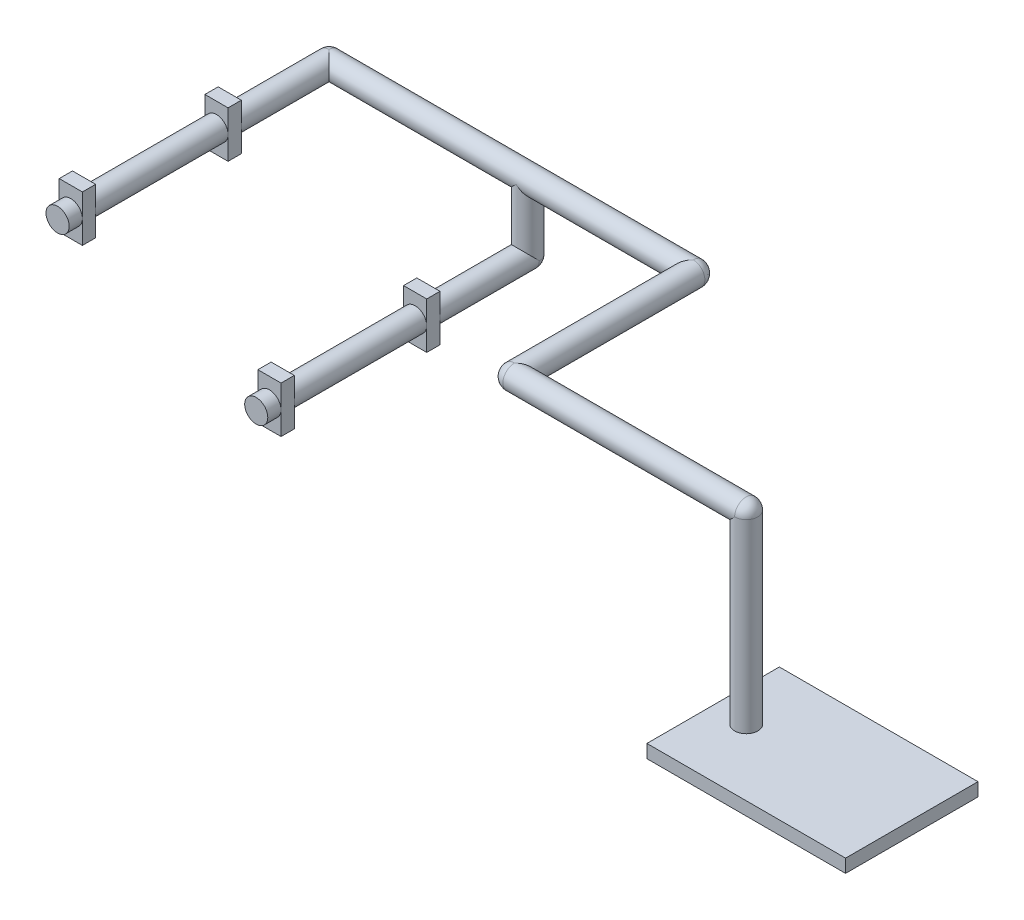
ISO-10303-21;
HEADER;
FILE_DESCRIPTION(('STEP AP214'),'2;1');
FILE_NAME('part.step','',(''),(''),'','','');
FILE_SCHEMA(('AUTOMOTIVE_DESIGN { 1 0 10303 214 1 1 1 1 }'));
ENDSEC;
DATA;
#1=APPLICATION_CONTEXT('core data for automotive mechanical design processes');
#2=APPLICATION_PROTOCOL_DEFINITION('international standard','automotive_design',2000,#1);
#3=PRODUCT_CONTEXT('',#1,'mechanical');
#4=PRODUCT('Part','Part','',(#3));
#5=PRODUCT_RELATED_PRODUCT_CATEGORY('part','',(#4));
#6=PRODUCT_DEFINITION_FORMATION('','',#4);
#7=PRODUCT_DEFINITION_CONTEXT('part definition',#1,'design');
#8=PRODUCT_DEFINITION('design','',#6,#7);
#9=PRODUCT_DEFINITION_SHAPE('','',#8);
#10=(LENGTH_UNIT() NAMED_UNIT(*) SI_UNIT(.MILLI.,.METRE.));
#11=(NAMED_UNIT(*) PLANE_ANGLE_UNIT() SI_UNIT($,.RADIAN.));
#12=(NAMED_UNIT(*) SI_UNIT($,.STERADIAN.) SOLID_ANGLE_UNIT());
#13=UNCERTAINTY_MEASURE_WITH_UNIT(LENGTH_MEASURE(1.E-05),#10,'distance_accuracy_value','');
#14=(GEOMETRIC_REPRESENTATION_CONTEXT(3) GLOBAL_UNCERTAINTY_ASSIGNED_CONTEXT((#13)) GLOBAL_UNIT_ASSIGNED_CONTEXT((#10,
#11,#12)) REPRESENTATION_CONTEXT('',''));
#15=CARTESIAN_POINT('',(0.,0.,0.));
#16=DIRECTION('',(0.,0.,1.));
#17=DIRECTION('',(1.,0.,0.));
#18=AXIS2_PLACEMENT_3D('',#15,#16,#17);
#19=CARTESIAN_POINT('',(50.,0.,54.));
#20=DIRECTION('',(0.,0.,-1.));
#21=DIRECTION('',(-1.,0.,0.));
#22=AXIS2_PLACEMENT_3D('',#19,#20,#21);
#23=CYLINDRICAL_SURFACE('',#22,3.5);
#24=CARTESIAN_POINT('',(50.,0.,0.));
#25=DIRECTION('',(0.,0.,1.));
#26=DIRECTION('',(1.,0.,0.));
#27=AXIS2_PLACEMENT_3D('',#24,#25,#26);
#28=CIRCLE('',#27,3.5);
#29=CARTESIAN_POINT('',(50.,-3.5,0.));
#30=VERTEX_POINT('',#29);
#31=CARTESIAN_POINT('',(50.,3.5,0.));
#32=VERTEX_POINT('',#31);
#33=EDGE_CURVE('E589',#30,#32,#28,.T.);
#34=ORIENTED_EDGE('',*,*,#33,.T.);
#35=CARTESIAN_POINT('',(50.,0.,0.));
#36=DIRECTION('',(-0.707106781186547,0.,-0.707106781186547));
#37=DIRECTION('',(-0.707106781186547,0.,0.707106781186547));
#38=AXIS2_PLACEMENT_3D('',#35,#36,#37);
#39=ELLIPSE('',#38,4.94974746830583,3.5);
#40=EDGE_CURVE('E584',#32,#30,#39,.F.);
#41=ORIENTED_EDGE('',*,*,#40,.T.);
#42=EDGE_LOOP('',(#34,#41));
#43=FACE_BOUND('',#42,.T.);
#44=CARTESIAN_POINT('',(50.,0.,54.));
#45=DIRECTION('',(-0.707106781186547,0.,-0.707106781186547));
#46=DIRECTION('',(0.707106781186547,0.,-0.707106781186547));
#47=AXIS2_PLACEMENT_3D('',#44,#45,#46);
#48=ELLIPSE('',#47,4.94974746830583,3.5);
#49=CARTESIAN_POINT('',(50.,-3.5,54.));
#50=VERTEX_POINT('',#49);
#51=CARTESIAN_POINT('',(50.,3.5,54.));
#52=VERTEX_POINT('',#51);
#53=EDGE_CURVE('E591',#50,#52,#48,.F.);
#54=ORIENTED_EDGE('',*,*,#53,.F.);
#55=CARTESIAN_POINT('',(50.,0.,54.));
#56=DIRECTION('',(0.,0.,1.));
#57=DIRECTION('',(1.,0.,0.));
#58=AXIS2_PLACEMENT_3D('',#55,#56,#57);
#59=CIRCLE('',#58,3.5);
#60=EDGE_CURVE('E587',#52,#50,#59,.T.);
#61=ORIENTED_EDGE('',*,*,#60,.F.);
#62=EDGE_LOOP('',(#54,#61));
#63=FACE_BOUND('',#62,.T.);
#64=ADVANCED_FACE('F32',(#43,#63),#23,.T.);
#65=CARTESIAN_POINT('',(50.,0.,0.));
#66=DIRECTION('',(-1.,0.,0.));
#67=DIRECTION('',(0.,0.,1.));
#68=AXIS2_PLACEMENT_3D('',#65,#66,#67);
#69=CYLINDRICAL_SURFACE('',#68,3.5);
#70=CARTESIAN_POINT('',(-60.,0.,0.));
#71=DIRECTION('',(-0.707106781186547,0.,0.707106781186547));
#72=DIRECTION('',(-0.707106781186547,0.,-0.707106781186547));
#73=AXIS2_PLACEMENT_3D('',#70,#71,#72);
#74=ELLIPSE('',#73,4.94974746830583,3.5);
#75=CARTESIAN_POINT('',(-60.,-3.5,0.));
#76=VERTEX_POINT('',#75);
#77=CARTESIAN_POINT('',(-60.,3.5,0.));
#78=VERTEX_POINT('',#77);
#79=EDGE_CURVE('E258',#76,#78,#74,.T.);
#80=ORIENTED_EDGE('',*,*,#79,.F.);
#81=CARTESIAN_POINT('',(-60.,0.,0.));
#82=DIRECTION('',(1.,0.,0.));
#83=DIRECTION('',(0.,0.,-1.));
#84=AXIS2_PLACEMENT_3D('',#81,#82,#83);
#85=CIRCLE('',#84,3.5);
#86=EDGE_CURVE('E249',#76,#78,#85,.T.);
#87=ORIENTED_EDGE('',*,*,#86,.T.);
#88=EDGE_LOOP('',(#80,#87));
#89=FACE_BOUND('',#88,.T.);
#90=CARTESIAN_POINT('',(0.,0.,0.));
#91=DIRECTION('',(-0.707106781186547,-0.707106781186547,0.));
#92=DIRECTION('',(-0.707106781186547,0.707106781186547,0.));
#93=AXIS2_PLACEMENT_3D('',#90,#91,#92);
#94=ELLIPSE('',#93,4.94974746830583,3.5);
#95=CARTESIAN_POINT('',(0.,0.,3.5));
#96=VERTEX_POINT('',#95);
#97=CARTESIAN_POINT('',(0.,0.,-3.5));
#98=VERTEX_POINT('',#97);
#99=EDGE_CURVE('E1152',#96,#98,#94,.F.);
#100=ORIENTED_EDGE('',*,*,#99,.T.);
#101=CARTESIAN_POINT('',(0.,0.,0.));
#102=DIRECTION('',(-0.707106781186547,0.707106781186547,0.));
#103=DIRECTION('',(-0.707106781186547,-0.707106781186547,0.));
#104=AXIS2_PLACEMENT_3D('',#101,#102,#103);
#105=ELLIPSE('',#104,4.94974746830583,3.5);
#106=EDGE_CURVE('E286',#98,#96,#105,.T.);
#107=ORIENTED_EDGE('',*,*,#106,.T.);
#108=EDGE_LOOP('',(#100,#107));
#109=FACE_BOUND('',#108,.T.);
#110=ORIENTED_EDGE('',*,*,#40,.F.);
#111=CARTESIAN_POINT('',(50.,0.,0.));
#112=DIRECTION('',(1.,0.,0.));
#113=DIRECTION('',(0.,0.,-1.));
#114=AXIS2_PLACEMENT_3D('',#111,#112,#113);
#115=CIRCLE('',#114,3.5);
#116=EDGE_CURVE('E259',#30,#32,#115,.T.);
#117=ORIENTED_EDGE('',*,*,#116,.F.);
#118=EDGE_LOOP('',(#110,#117));
#119=FACE_BOUND('',#118,.T.);
#120=ADVANCED_FACE('F34',(#89,#109,#119),#69,.T.);
#121=CARTESIAN_POINT('',(-3.5,-12.9891304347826,78.));
#122=DIRECTION('',(0.,0.,1.));
#123=DIRECTION('',(1.,0.,0.));
#124=AXIS2_PLACEMENT_3D('',#121,#122,#123);
#125=PLANE('',#124);
#126=DIRECTION('',(-1.,0.,0.));
#127=VECTOR('',#126,1.);
#128=CARTESIAN_POINT('',(3.5,-12.9891304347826,78.));
#129=LINE('',#128,#127);
#130=CARTESIAN_POINT('',(3.5,-12.9891304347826,78.));
#131=VERTEX_POINT('',#130);
#132=CARTESIAN_POINT('',(-3.5,-12.9891304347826,78.));
#133=VERTEX_POINT('',#132);
#134=EDGE_CURVE('E566',#131,#133,#129,.T.);
#135=ORIENTED_EDGE('',*,*,#134,.T.);
#136=DIRECTION('',(0.,-1.,0.));
#137=VECTOR('',#136,1.);
#138=CARTESIAN_POINT('',(-3.5,-12.9891304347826,78.));
#139=LINE('',#138,#137);
#140=CARTESIAN_POINT('',(-3.5,-26.9891304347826,78.));
#141=VERTEX_POINT('',#140);
#142=EDGE_CURVE('E564',#133,#141,#139,.T.);
#143=ORIENTED_EDGE('',*,*,#142,.T.);
#144=DIRECTION('',(1.,0.,0.));
#145=VECTOR('',#144,1.);
#146=CARTESIAN_POINT('',(-3.5,-26.9891304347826,78.));
#147=LINE('',#146,#145);
#148=CARTESIAN_POINT('',(3.5,-26.9891304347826,78.));
#149=VERTEX_POINT('',#148);
#150=EDGE_CURVE('E562',#141,#149,#147,.T.);
#151=ORIENTED_EDGE('',*,*,#150,.T.);
#152=DIRECTION('',(0.,1.,0.));
#153=VECTOR('',#152,1.);
#154=CARTESIAN_POINT('',(3.5,-26.9891304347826,78.));
#155=LINE('',#154,#153);
#156=EDGE_CURVE('E560',#149,#131,#155,.T.);
#157=ORIENTED_EDGE('',*,*,#156,.T.);
#158=EDGE_LOOP('',(#135,#143,#151,#157));
#159=FACE_BOUND('',#158,.T.);
#160=CARTESIAN_POINT('',(0.,-20.,78.));
#161=DIRECTION('',(0.,0.,1.));
#162=DIRECTION('',(1.,0.,0.));
#163=AXIS2_PLACEMENT_3D('',#160,#161,#162);
#164=CIRCLE('',#163,3.48914731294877);
#165=CARTESIAN_POINT('',(3.48914731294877,-20.,78.));
#166=VERTEX_POINT('',#165);
#167=EDGE_CURVE('E581',#166,#166,#164,.T.);
#168=ORIENTED_EDGE('',*,*,#167,.F.);
#169=EDGE_LOOP('',(#168));
#170=FACE_BOUND('',#169,.T.);
#171=ADVANCED_FACE('F495',(#159,#170),#125,.T.);
#172=CARTESIAN_POINT('',(-3.5,-26.9891304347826,34.));
#173=DIRECTION('',(0.,0.,1.));
#174=DIRECTION('',(1.,0.,0.));
#175=AXIS2_PLACEMENT_3D('',#172,#173,#174);
#176=PLANE('',#175);
#177=DIRECTION('',(0.,-1.,0.));
#178=VECTOR('',#177,1.);
#179=CARTESIAN_POINT('',(-3.5,-12.9891304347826,34.));
#180=LINE('',#179,#178);
#181=CARTESIAN_POINT('',(-3.5,-12.9891304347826,34.));
#182=VERTEX_POINT('',#181);
#183=CARTESIAN_POINT('',(-3.5,-26.9891304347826,34.));
#184=VERTEX_POINT('',#183);
#185=EDGE_CURVE('E378',#182,#184,#180,.T.);
#186=ORIENTED_EDGE('',*,*,#185,.T.);
#187=DIRECTION('',(1.,0.,0.));
#188=VECTOR('',#187,1.);
#189=CARTESIAN_POINT('',(-3.5,-26.9891304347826,34.));
#190=LINE('',#189,#188);
#191=CARTESIAN_POINT('',(3.5,-26.9891304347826,34.));
#192=VERTEX_POINT('',#191);
#193=EDGE_CURVE('E381',#184,#192,#190,.T.);
#194=ORIENTED_EDGE('',*,*,#193,.T.);
#195=DIRECTION('',(0.,1.,0.));
#196=VECTOR('',#195,1.);
#197=CARTESIAN_POINT('',(3.5,-12.9891304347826,34.));
#198=LINE('',#197,#196);
#199=CARTESIAN_POINT('',(3.5,-12.9891304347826,34.));
#200=VERTEX_POINT('',#199);
#201=EDGE_CURVE('E384',#192,#200,#198,.T.);
#202=ORIENTED_EDGE('',*,*,#201,.T.);
#203=DIRECTION('',(-1.,0.,0.));
#204=VECTOR('',#203,1.);
#205=CARTESIAN_POINT('',(-3.5,-12.9891304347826,34.));
#206=LINE('',#205,#204);
#207=EDGE_CURVE('E388',#200,#182,#206,.T.);
#208=ORIENTED_EDGE('',*,*,#207,.T.);
#209=EDGE_LOOP('',(#186,#194,#202,#208));
#210=FACE_BOUND('',#209,.T.);
#211=CARTESIAN_POINT('',(0.,-20.,34.));
#212=DIRECTION('',(0.,0.,1.));
#213=DIRECTION('',(1.,0.,0.));
#214=AXIS2_PLACEMENT_3D('',#211,#212,#213);
#215=CIRCLE('',#214,3.48914731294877);
#216=CARTESIAN_POINT('',(3.48914731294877,-20.,34.));
#217=VERTEX_POINT('',#216);
#218=EDGE_CURVE('E544',#217,#217,#215,.T.);
#219=ORIENTED_EDGE('',*,*,#218,.F.);
#220=EDGE_LOOP('',(#219));
#221=FACE_BOUND('',#220,.T.);
#222=ADVANCED_FACE('F439',(#210,#221),#176,.T.);
#223=CARTESIAN_POINT('',(-63.5,7.,78.));
#224=DIRECTION('',(0.,0.,-1.));
#225=DIRECTION('',(-1.,0.,0.));
#226=AXIS2_PLACEMENT_3D('',#223,#224,#225);
#227=PLANE('',#226);
#228=CARTESIAN_POINT('',(-60.,0.,78.));
#229=DIRECTION('',(0.,0.,1.));
#230=DIRECTION('',(1.,0.,0.));
#231=AXIS2_PLACEMENT_3D('',#228,#229,#230);
#232=CIRCLE('',#231,3.5);
#233=CARTESIAN_POINT('',(-56.5,0.,78.));
#234=VERTEX_POINT('',#233);
#235=CARTESIAN_POINT('',(-63.5,0.,78.));
#236=VERTEX_POINT('',#235);
#237=EDGE_CURVE('E398',#234,#236,#232,.T.);
#238=ORIENTED_EDGE('',*,*,#237,.F.);
#239=DIRECTION('',(0.,1.,0.));
#240=VECTOR('',#239,1.);
#241=CARTESIAN_POINT('',(-56.5,-7.,78.));
#242=LINE('',#241,#240);
#243=CARTESIAN_POINT('',(-56.5,7.,78.));
#244=VERTEX_POINT('',#243);
#245=EDGE_CURVE('E1083',#234,#244,#242,.T.);
#246=ORIENTED_EDGE('',*,*,#245,.T.);
#247=DIRECTION('',(-1.,0.,0.));
#248=VECTOR('',#247,1.);
#249=CARTESIAN_POINT('',(-56.5,7.,78.));
#250=LINE('',#249,#248);
#251=CARTESIAN_POINT('',(-63.5,7.,78.));
#252=VERTEX_POINT('',#251);
#253=EDGE_CURVE('E1063',#244,#252,#250,.T.);
#254=ORIENTED_EDGE('',*,*,#253,.T.);
#255=DIRECTION('',(0.,-1.,0.));
#256=VECTOR('',#255,1.);
#257=CARTESIAN_POINT('',(-63.5,7.,78.));
#258=LINE('',#257,#256);
#259=EDGE_CURVE('E1055',#252,#236,#258,.T.);
#260=ORIENTED_EDGE('',*,*,#259,.T.);
#261=EDGE_LOOP('',(#238,#246,#254,#260));
#262=FACE_BOUND('',#261,.T.);
#263=ADVANCED_FACE('F435',(#262),#227,.F.);
#264=EDGE_CURVE('E1041',#236,#234,#232,.T.);
#265=ORIENTED_EDGE('',*,*,#264,.F.);
#266=CARTESIAN_POINT('',(-63.5,-7.,78.));
#267=VERTEX_POINT('',#266);
#268=EDGE_CURVE('E1043',#236,#267,#258,.T.);
#269=ORIENTED_EDGE('',*,*,#268,.T.);
#270=DIRECTION('',(1.,0.,0.));
#271=VECTOR('',#270,1.);
#272=CARTESIAN_POINT('',(-63.5,-7.,78.));
#273=LINE('',#272,#271);
#274=CARTESIAN_POINT('',(-56.5,-7.,78.));
#275=VERTEX_POINT('',#274);
#276=EDGE_CURVE('E1065',#267,#275,#273,.T.);
#277=ORIENTED_EDGE('',*,*,#276,.T.);
#278=EDGE_CURVE('E1046',#275,#234,#242,.T.);
#279=ORIENTED_EDGE('',*,*,#278,.T.);
#280=EDGE_LOOP('',(#265,#269,#277,#279));
#281=FACE_BOUND('',#280,.T.);
#282=ADVANCED_FACE('F438',(#281),#227,.F.);
#283=CARTESIAN_POINT('',(-63.5,7.,34.));
#284=DIRECTION('',(0.,0.,1.));
#285=DIRECTION('',(1.,0.,0.));
#286=AXIS2_PLACEMENT_3D('',#283,#284,#285);
#287=PLANE('',#286);
#288=CARTESIAN_POINT('',(-60.,0.,34.));
#289=DIRECTION('',(0.,0.,1.));
#290=DIRECTION('',(1.,0.,0.));
#291=AXIS2_PLACEMENT_3D('',#288,#289,#290);
#292=CIRCLE('',#291,3.5);
#293=CARTESIAN_POINT('',(-56.5,0.,34.));
#294=VERTEX_POINT('',#293);
#295=CARTESIAN_POINT('',(-63.5,0.,34.));
#296=VERTEX_POINT('',#295);
#297=EDGE_CURVE('E1095',#294,#296,#292,.T.);
#298=ORIENTED_EDGE('',*,*,#297,.F.);
#299=DIRECTION('',(0.,1.,0.));
#300=VECTOR('',#299,1.);
#301=CARTESIAN_POINT('',(-56.5,7.,34.));
#302=LINE('',#301,#300);
#303=CARTESIAN_POINT('',(-56.5,7.,34.));
#304=VERTEX_POINT('',#303);
#305=EDGE_CURVE('E1119',#294,#304,#302,.T.);
#306=ORIENTED_EDGE('',*,*,#305,.T.);
#307=DIRECTION('',(-1.,0.,0.));
#308=VECTOR('',#307,1.);
#309=CARTESIAN_POINT('',(-63.5,7.,34.));
#310=LINE('',#309,#308);
#311=CARTESIAN_POINT('',(-63.5,7.,34.));
#312=VERTEX_POINT('',#311);
#313=EDGE_CURVE('E1122',#304,#312,#310,.T.);
#314=ORIENTED_EDGE('',*,*,#313,.T.);
#315=DIRECTION('',(0.,-1.,0.));
#316=VECTOR('',#315,1.);
#317=CARTESIAN_POINT('',(-63.5,7.,34.));
#318=LINE('',#317,#316);
#319=EDGE_CURVE('E1114',#312,#296,#318,.T.);
#320=ORIENTED_EDGE('',*,*,#319,.T.);
#321=EDGE_LOOP('',(#298,#306,#314,#320));
#322=FACE_BOUND('',#321,.T.);
#323=ADVANCED_FACE('F470',(#322),#287,.T.);
#324=CARTESIAN_POINT('',(0.,-20.,0.));
#325=DIRECTION('',(0.,1.,0.));
#326=DIRECTION('',(0.,0.,1.));
#327=AXIS2_PLACEMENT_3D('',#324,#325,#326);
#328=CYLINDRICAL_SURFACE('',#327,3.5);
#329=ORIENTED_EDGE('',*,*,#106,.F.);
#330=ORIENTED_EDGE('',*,*,#99,.F.);
#331=EDGE_LOOP('',(#329,#330));
#332=FACE_BOUND('',#331,.T.);
#333=CARTESIAN_POINT('',(-3.5,-19.9782608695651,0.));
#334=CARTESIAN_POINT('',(-3.50000000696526,-19.9782652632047,0.000751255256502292));
#335=CARTESIAN_POINT('',(-3.49999975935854,-19.9781832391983,0.00149521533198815));
#336=CARTESIAN_POINT('',(-3.49999883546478,-19.9778905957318,0.00294028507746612));
#337=CARTESIAN_POINT('',(-3.49999816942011,-19.977683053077,0.00364199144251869));
#338=CARTESIAN_POINT('',(-3.49999544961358,-19.9768718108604,0.00584912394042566));
#339=CARTESIAN_POINT('',(-3.49999269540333,-19.9760942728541,0.00728602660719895));
#340=CARTESIAN_POINT('',(-3.49998579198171,-19.9743497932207,0.0100684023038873));
#341=CARTESIAN_POINT('',(-3.49998161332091,-19.9733790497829,0.0114111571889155));
#342=CARTESIAN_POINT('',(-3.49993452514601,-19.9636146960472,0.0244468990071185));
#343=CARTESIAN_POINT('',(-3.49984475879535,-19.9531430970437,0.0347727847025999));
#344=CARTESIAN_POINT('',(-3.49916899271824,-19.9011980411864,0.0863377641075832));
#345=CARTESIAN_POINT('',(-3.49790152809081,-19.8604511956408,0.127883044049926));
#346=CARTESIAN_POINT('',(-3.49190297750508,-19.7374851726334,0.252193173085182));
#347=CARTESIAN_POINT('',(-3.4849729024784,-19.6546634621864,0.334503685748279));
#348=CARTESIAN_POINT('',(-3.46522649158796,-19.4898102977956,0.499000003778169));
#349=CARTESIAN_POINT('',(-3.45241094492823,-19.4077787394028,0.581185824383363));
#350=CARTESIAN_POINT('',(-3.41229546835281,-19.1999905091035,0.789169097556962));
#351=CARTESIAN_POINT('',(-3.38091091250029,-19.0745477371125,0.914546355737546));
#352=CARTESIAN_POINT('',(-3.30363067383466,-18.8258833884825,1.16316964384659));
#353=CARTESIAN_POINT('',(-3.25772517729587,-18.7026633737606,1.28641417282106));
#354=CARTESIAN_POINT('',(-3.15083135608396,-18.4594164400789,1.52968297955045));
#355=CARTESIAN_POINT('',(-3.08983470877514,-18.3393913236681,1.64970543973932));
#356=CARTESIAN_POINT('',(-2.9521282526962,-18.1040207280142,1.8850765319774));
#357=CARTESIAN_POINT('',(-2.87542972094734,-17.9886719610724,2.00042844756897));
#358=CARTESIAN_POINT('',(-2.68566217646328,-17.7380233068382,2.25108171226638));
#359=CARTESIAN_POINT('',(-2.56828296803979,-17.604324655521,2.38478126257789));
#360=CARTESIAN_POINT('',(-2.30692347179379,-17.3507066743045,2.63840123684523));
#361=CARTESIAN_POINT('',(-2.162990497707,-17.2307634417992,2.75834556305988));
#362=CARTESIAN_POINT('',(-1.87864363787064,-17.0319841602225,2.95712635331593));
#363=CARTESIAN_POINT('',(-1.74308129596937,-16.9497001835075,3.03941083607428));
#364=CARTESIAN_POINT('',(-1.45483773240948,-16.8017005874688,3.18741131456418));
#365=CARTESIAN_POINT('',(-1.30217661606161,-16.7359657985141,3.25314648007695));
#366=CARTESIAN_POINT('',(-1.00979007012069,-16.6350167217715,3.35409610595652));
#367=CARTESIAN_POINT('',(-0.872357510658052,-16.5964973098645,3.39261571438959));
#368=CARTESIAN_POINT('',(-0.590293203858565,-16.536244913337,3.45286841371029));
#369=CARTESIAN_POINT('',(-0.44566623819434,-16.5145009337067,3.47461249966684));
#370=CARTESIAN_POINT('',(-0.152705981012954,-16.489347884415,3.49976567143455));
#371=CARTESIAN_POINT('',(-0.00436165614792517,-16.4860021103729,3.50311146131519));
#372=CARTESIAN_POINT('',(0.290781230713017,-16.4980871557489,3.49102635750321));
#373=CARTESIAN_POINT('',(0.437579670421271,-16.5135194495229,3.47559398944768));
#374=CARTESIAN_POINT('',(0.717690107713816,-16.5606934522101,3.42841975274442));
#375=CARTESIAN_POINT('',(0.85130671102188,-16.5915479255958,3.39756512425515));
#376=CARTESIAN_POINT('',(1.11036049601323,-16.6671642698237,3.3219483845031));
#377=CARTESIAN_POINT('',(1.23579429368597,-16.7119318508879,3.27718056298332));
#378=CARTESIAN_POINT('',(1.52215724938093,-16.8323110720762,3.15680065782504));
#379=CARTESIAN_POINT('',(1.67866178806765,-16.9131892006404,3.07592204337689));
#380=CARTESIAN_POINT('',(1.97105433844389,-17.0917940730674,2.89731599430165));
#381=CARTESIAN_POINT('',(2.1069032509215,-17.1895520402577,2.79955733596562));
#382=CARTESIAN_POINT('',(2.40458606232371,-17.4360829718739,2.55302437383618));
#383=CARTESIAN_POINT('',(2.55733551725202,-17.5903193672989,2.39878649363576));
#384=CARTESIAN_POINT('',(2.82640826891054,-17.9140420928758,2.07506009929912));
#385=CARTESIAN_POINT('',(2.94264737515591,-18.0835625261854,1.90553748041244));
#386=CARTESIAN_POINT('',(3.10860997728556,-18.3751710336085,1.61392279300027));
#387=CARTESIAN_POINT('',(3.167660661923,-18.4946825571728,1.49440809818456));
#388=CARTESIAN_POINT('',(3.27099794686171,-18.7369170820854,1.25216710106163));
#389=CARTESIAN_POINT('',(3.31527811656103,-18.8596414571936,1.12943942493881));
#390=CARTESIAN_POINT('',(3.38945906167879,-19.1069106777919,0.882151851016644));
#391=CARTESIAN_POINT('',(3.41939336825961,-19.2314505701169,0.757596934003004));
#392=CARTESIAN_POINT('',(3.46538137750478,-19.481761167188,0.507265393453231));
#393=CARTESIAN_POINT('',(3.48144224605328,-19.6075312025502,0.381489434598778));
#394=CARTESIAN_POINT('',(3.49348624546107,-19.7719596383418,0.216902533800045));
#395=CARTESIAN_POINT('',(3.49566746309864,-19.8104835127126,0.178330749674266));
#396=CARTESIAN_POINT('',(3.4980489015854,-19.8699259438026,0.118724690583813));
#397=CARTESIAN_POINT('',(3.49869889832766,-19.8908527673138,0.0977230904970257));
#398=CARTESIAN_POINT('',(3.49940758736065,-19.9228743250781,0.0653756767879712));
#399=CARTESIAN_POINT('',(3.49960069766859,-19.9340213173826,0.0540756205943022));
#400=CARTESIAN_POINT('',(3.49981027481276,-19.950699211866,0.0369021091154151));
#401=CARTESIAN_POINT('',(3.49986688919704,-19.9562886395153,0.0311008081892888));
#402=CARTESIAN_POINT('',(3.49993049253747,-19.9643874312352,0.0222470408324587));
#403=CARTESIAN_POINT('',(3.49994808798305,-19.9670213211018,0.0192925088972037));
#404=CARTESIAN_POINT('',(3.49997632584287,-19.9721139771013,0.0132373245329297));
#405=CARTESIAN_POINT('',(3.49998705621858,-19.9745745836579,0.0101390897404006));
#406=CARTESIAN_POINT('',(3.49999434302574,-19.9765687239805,0.00630216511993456));
#407=CARTESIAN_POINT('',(3.49999498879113,-19.9767506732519,0.00593410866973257));
#408=CARTESIAN_POINT('',(3.49999617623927,-19.9770913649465,0.00518746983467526));
#409=CARTESIAN_POINT('',(3.49999671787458,-19.9772500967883,0.00480888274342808));
#410=CARTESIAN_POINT('',(3.49999816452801,-19.9776813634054,0.00366361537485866));
#411=CARTESIAN_POINT('',(3.49999890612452,-19.9779131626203,0.00287986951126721));
#412=CARTESIAN_POINT('',(3.49999958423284,-19.9781276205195,0.00173994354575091));
#413=CARTESIAN_POINT('',(3.49999973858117,-19.9781769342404,0.00139598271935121));
#414=CARTESIAN_POINT('',(3.49999994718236,-19.9782438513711,0.000701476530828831));
#415=CARTESIAN_POINT('',(3.50000000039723,-19.9782611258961,0.000350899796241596));
#416=CARTESIAN_POINT('',(3.50000000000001,-19.9782608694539,-2.0897374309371E-11));
#417=B_SPLINE_CURVE_WITH_KNOTS('',3,(#333,#334,#335,#336,#337,#338,#339,#340,#341,#342,#343,
#344,#345,#346,#347,#348,#349,#350,#351,#352,#353,#354,#355,#356,#357,#358,#359,#360,#361,#362,
#363,#364,#365,#366,#367,#368,#369,#370,#371,#372,#373,#374,#375,#376,#377,#378,#379,#380,#381,
#382,#383,#384,#385,#386,#387,#388,#389,#390,#391,#392,#393,#394,#395,#396,#397,#398,#399,#400,
#401,#402,#403,#404,#405,#406,#407,#408,#409,#410,#411,#412,#413,#414,#415,#416),.UNSPECIFIED.,
.F.,.F.,(4,2,2,2,2,2,2,2,2,2,2,2,2,2,2,2,2,2,2,2,2,2,2,2,2,2,2,2,2,2,2,2,2,2,2,2,2,2,2,2,2,4),
(0.,0.00223777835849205,0.00442280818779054,0.00928469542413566,0.0142538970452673,
0.0581722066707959,0.233134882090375,0.583596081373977,0.934010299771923,1.47368769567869,
2.01373060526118,2.55407201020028,3.09402669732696,3.75959374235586,4.42398613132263,
4.95800755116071,5.49140751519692,5.93304271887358,6.37438821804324,6.81725113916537,
7.26014883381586,7.68007971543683,8.10018317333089,8.67851328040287,9.25792483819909,
10.0525031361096,10.8489004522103,11.3853753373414,11.9220834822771,12.4575309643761,
12.9927017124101,13.156374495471,13.2453261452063,13.2929637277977,13.3171076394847,
13.3290076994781,13.34075205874,13.3419827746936,13.3432140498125,13.345650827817,
13.3466919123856,13.3477436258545),.UNSPECIFIED.);
#418=CARTESIAN_POINT('',(-3.5,-19.9782608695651,0.));
#419=VERTEX_POINT('',#418);
#420=CARTESIAN_POINT('',(3.5,-19.9782608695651,0.));
#421=VERTEX_POINT('',#420);
#422=EDGE_CURVE('E273',#419,#421,#417,.T.);
#423=ORIENTED_EDGE('',*,*,#422,.T.);
#424=CARTESIAN_POINT('',(0.,-19.9891304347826,0.));
#425=DIRECTION('',(0.,0.,1.));
#426=DIRECTION('',(0.999995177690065,-0.00310557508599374,0.));
#427=AXIS2_PLACEMENT_3D('',#424,#425,#426);
#428=CIRCLE('',#427,3.50001687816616);
#429=CARTESIAN_POINT('',(3.5,-20.,0.));
#430=VERTEX_POINT('',#429);
#431=EDGE_CURVE('E276',#430,#421,#428,.T.);
#432=ORIENTED_EDGE('',*,*,#431,.F.);
#433=CARTESIAN_POINT('',(0.,-20.,0.));
#434=DIRECTION('',(0.,1.,0.));
#435=DIRECTION('',(0.,0.,1.));
#436=AXIS2_PLACEMENT_3D('',#433,#434,#435);
#437=CIRCLE('',#436,3.5);
#438=CARTESIAN_POINT('',(-3.5,-20.,0.));
#439=VERTEX_POINT('',#438);
#440=EDGE_CURVE('E260',#430,#439,#437,.T.);
#441=ORIENTED_EDGE('',*,*,#440,.T.);
#442=CARTESIAN_POINT('',(0.,-19.9891304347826,0.));
#443=DIRECTION('',(0.,0.,1.));
#444=DIRECTION('',(-0.999995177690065,0.00310557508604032,0.));
#445=AXIS2_PLACEMENT_3D('',#442,#443,#444);
#446=CIRCLE('',#445,3.50001687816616);
#447=EDGE_CURVE('E339',#419,#439,#446,.T.);
#448=ORIENTED_EDGE('',*,*,#447,.F.);
#449=EDGE_LOOP('',(#423,#432,#441,#448));
#450=FACE_BOUND('',#449,.T.);
#451=ADVANCED_FACE('F289',(#332,#450),#328,.T.);
#452=CARTESIAN_POINT('',(0.,-20.,0.));
#453=DIRECTION('',(0.,1.,0.));
#454=DIRECTION('',(0.,0.,1.));
#455=AXIS2_PLACEMENT_3D('',#452,#453,#454);
#456=PLANE('',#455);
#457=ORIENTED_EDGE('',*,*,#440,.F.);
#458=CARTESIAN_POINT('',(0.,-20.,0.0108695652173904));
#459=DIRECTION('',(0.,1.,0.));
#460=DIRECTION('',(0.,0.,1.));
#461=AXIS2_PLACEMENT_3D('',#458,#459,#460);
#462=CIRCLE('',#461,3.50001687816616);
#463=EDGE_CURVE('E36',#430,#439,#462,.T.);
#464=ORIENTED_EDGE('',*,*,#463,.T.);
#465=EDGE_LOOP('',(#457,#464));
#466=FACE_BOUND('',#465,.T.);
#467=ADVANCED_FACE('F296',(#466),#456,.F.);
#468=CARTESIAN_POINT('',(0.,-19.9891304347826,30.));
#469=DIRECTION('',(0.,0.,-1.));
#470=DIRECTION('',(-1.,0.,0.));
#471=AXIS2_PLACEMENT_3D('',#468,#469,#470);
#472=CYLINDRICAL_SURFACE('',#471,3.50001687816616);
#473=ORIENTED_EDGE('',*,*,#422,.F.);
#474=ORIENTED_EDGE('',*,*,#447,.T.);
#475=CARTESIAN_POINT('',(0.,-19.9891304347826,0.));
#476=DIRECTION('',(0.,0.,1.));
#477=DIRECTION('',(1.,0.,0.));
#478=AXIS2_PLACEMENT_3D('',#475,#476,#477);
#479=CIRCLE('',#478,3.50001687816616);
#480=EDGE_CURVE('E263',#439,#430,#479,.T.);
#481=ORIENTED_EDGE('',*,*,#480,.T.);
#482=ORIENTED_EDGE('',*,*,#431,.T.);
#483=EDGE_LOOP('',(#473,#474,#481,#482));
#484=FACE_BOUND('',#483,.T.);
#485=CARTESIAN_POINT('',(0.,-19.9891304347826,30.));
#486=DIRECTION('',(0.,0.,1.));
#487=DIRECTION('',(1.,0.,0.));
#488=AXIS2_PLACEMENT_3D('',#485,#486,#487);
#489=CIRCLE('',#488,3.50001687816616);
#490=CARTESIAN_POINT('',(3.5,-19.978260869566,30.));
#491=VERTEX_POINT('',#490);
#492=CARTESIAN_POINT('',(-3.5,-19.9782608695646,30.));
#493=VERTEX_POINT('',#492);
#494=EDGE_CURVE('E328',#491,#493,#489,.T.);
#495=ORIENTED_EDGE('',*,*,#494,.F.);
#496=CARTESIAN_POINT('',(3.5,-19.9999999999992,30.));
#497=DIRECTION('',(0.,1.,0.));
#498=VECTOR('',#497,1.);
#499=LINE('',#496,#498);
#500=CARTESIAN_POINT('',(3.5,-19.9999999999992,30.));
#501=VERTEX_POINT('',#500);
#502=EDGE_CURVE('E42',#501,#491,#499,.T.);
#503=ORIENTED_EDGE('',*,*,#502,.F.);
#504=CARTESIAN_POINT('',(-3.5,-20.0000000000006,30.));
#505=VERTEX_POINT('',#504);
#506=EDGE_CURVE('E53',#505,#501,#489,.T.);
#507=ORIENTED_EDGE('',*,*,#506,.F.);
#508=CARTESIAN_POINT('',(-3.5,-19.9782608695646,30.));
#509=DIRECTION('',(0.,-1.,0.));
#510=VECTOR('',#509,1.);
#511=LINE('',#508,#510);
#512=EDGE_CURVE('E11',#493,#505,#511,.T.);
#513=ORIENTED_EDGE('',*,*,#512,.F.);
#514=EDGE_LOOP('',(#495,#503,#507,#513));
#515=FACE_BOUND('',#514,.T.);
#516=ADVANCED_FACE('F292',(#484,#515),#472,.T.);
#517=CARTESIAN_POINT('',(-60.,0.,30.));
#518=DIRECTION('',(0.,0.,-1.));
#519=DIRECTION('',(-1.,0.,0.));
#520=AXIS2_PLACEMENT_3D('',#517,#518,#519);
#521=CYLINDRICAL_SURFACE('',#520,3.5);
#522=CARTESIAN_POINT('',(-60.,0.,30.));
#523=DIRECTION('',(0.,0.,1.));
#524=DIRECTION('',(1.,0.,0.));
#525=AXIS2_PLACEMENT_3D('',#522,#523,#524);
#526=CIRCLE('',#525,3.5);
#527=CARTESIAN_POINT('',(-56.5,0.,30.));
#528=VERTEX_POINT('',#527);
#529=CARTESIAN_POINT('',(-63.5,0.,30.));
#530=VERTEX_POINT('',#529);
#531=EDGE_CURVE('E264',#528,#530,#526,.T.);
#532=ORIENTED_EDGE('',*,*,#531,.F.);
#533=EDGE_CURVE('E253',#530,#528,#526,.T.);
#534=ORIENTED_EDGE('',*,*,#533,.F.);
#535=EDGE_LOOP('',(#532,#534));
#536=FACE_BOUND('',#535,.T.);
#537=CARTESIAN_POINT('',(-60.,0.,0.));
#538=DIRECTION('',(0.,0.,1.));
#539=DIRECTION('',(1.,0.,0.));
#540=AXIS2_PLACEMENT_3D('',#537,#538,#539);
#541=CIRCLE('',#540,3.5);
#542=EDGE_CURVE('E246',#78,#76,#541,.T.);
#543=ORIENTED_EDGE('',*,*,#542,.T.);
#544=ORIENTED_EDGE('',*,*,#79,.T.);
#545=EDGE_LOOP('',(#543,#544));
#546=FACE_BOUND('',#545,.T.);
#547=ADVANCED_FACE('F262',(#536,#546),#521,.T.);
#548=CARTESIAN_POINT('',(-63.5,7.,30.));
#549=DIRECTION('',(0.,0.,1.));
#550=DIRECTION('',(1.,0.,0.));
#551=AXIS2_PLACEMENT_3D('',#548,#549,#550);
#552=PLANE('',#551);
#553=DIRECTION('',(0.,1.,0.));
#554=VECTOR('',#553,1.);
#555=CARTESIAN_POINT('',(-56.5,7.,30.));
#556=LINE('',#555,#554);
#557=CARTESIAN_POINT('',(-56.5,7.,30.));
#558=VERTEX_POINT('',#557);
#559=EDGE_CURVE('E1107',#528,#558,#556,.T.);
#560=ORIENTED_EDGE('',*,*,#559,.F.);
#561=ORIENTED_EDGE('',*,*,#531,.T.);
#562=DIRECTION('',(0.,-1.,0.));
#563=VECTOR('',#562,1.);
#564=CARTESIAN_POINT('',(-63.5,7.,30.));
#565=LINE('',#564,#563);
#566=CARTESIAN_POINT('',(-63.5,7.,30.));
#567=VERTEX_POINT('',#566);
#568=EDGE_CURVE('E1103',#567,#530,#565,.T.);
#569=ORIENTED_EDGE('',*,*,#568,.F.);
#570=DIRECTION('',(-1.,0.,0.));
#571=VECTOR('',#570,1.);
#572=CARTESIAN_POINT('',(-63.5,7.,30.));
#573=LINE('',#572,#571);
#574=EDGE_CURVE('E1111',#558,#567,#573,.T.);
#575=ORIENTED_EDGE('',*,*,#574,.F.);
#576=EDGE_LOOP('',(#560,#561,#569,#575));
#577=FACE_BOUND('',#576,.T.);
#578=ADVANCED_FACE('F461',(#577),#552,.F.);
#579=CARTESIAN_POINT('',(-63.5,-7.,30.));
#580=VERTEX_POINT('',#579);
#581=EDGE_CURVE('E1102',#530,#580,#565,.T.);
#582=ORIENTED_EDGE('',*,*,#581,.F.);
#583=ORIENTED_EDGE('',*,*,#533,.T.);
#584=CARTESIAN_POINT('',(-56.5,-7.,30.));
#585=VERTEX_POINT('',#584);
#586=EDGE_CURVE('E1108',#585,#528,#556,.T.);
#587=ORIENTED_EDGE('',*,*,#586,.F.);
#588=DIRECTION('',(1.,0.,0.));
#589=VECTOR('',#588,1.);
#590=CARTESIAN_POINT('',(-63.5,-7.,30.));
#591=LINE('',#590,#589);
#592=EDGE_CURVE('E1105',#580,#585,#591,.T.);
#593=ORIENTED_EDGE('',*,*,#592,.F.);
#594=EDGE_LOOP('',(#582,#583,#587,#593));
#595=FACE_BOUND('',#594,.T.);
#596=ADVANCED_FACE('F464',(#595),#552,.F.);
#597=CARTESIAN_POINT('',(-63.5,7.,34.));
#598=DIRECTION('',(1.,0.,0.));
#599=DIRECTION('',(0.,0.,-1.));
#600=AXIS2_PLACEMENT_3D('',#597,#598,#599);
#601=PLANE('',#600);
#602=ORIENTED_EDGE('',*,*,#568,.T.);
#603=ORIENTED_EDGE('',*,*,#581,.T.);
#604=DIRECTION('',(0.,0.,-1.));
#605=VECTOR('',#604,1.);
#606=CARTESIAN_POINT('',(-63.5,-7.,34.));
#607=LINE('',#606,#605);
#608=CARTESIAN_POINT('',(-63.5,-7.,34.));
#609=VERTEX_POINT('',#608);
#610=EDGE_CURVE('E254',#609,#580,#607,.T.);
#611=ORIENTED_EDGE('',*,*,#610,.F.);
#612=EDGE_CURVE('E1113',#296,#609,#318,.T.);
#613=ORIENTED_EDGE('',*,*,#612,.F.);
#614=ORIENTED_EDGE('',*,*,#319,.F.);
#615=DIRECTION('',(0.,0.,-1.));
#616=VECTOR('',#615,1.);
#617=CARTESIAN_POINT('',(-63.5,7.,34.));
#618=LINE('',#617,#616);
#619=EDGE_CURVE('E1124',#312,#567,#618,.T.);
#620=ORIENTED_EDGE('',*,*,#619,.T.);
#621=EDGE_LOOP('',(#602,#603,#611,#613,#614,#620));
#622=FACE_BOUND('',#621,.T.);
#623=ADVANCED_FACE('F480',(#622),#601,.F.);
#624=CARTESIAN_POINT('',(-63.5,-7.,34.));
#625=DIRECTION('',(0.,1.,0.));
#626=DIRECTION('',(-1.,0.,0.));
#627=AXIS2_PLACEMENT_3D('',#624,#625,#626);
#628=PLANE('',#627);
#629=ORIENTED_EDGE('',*,*,#592,.T.);
#630=DIRECTION('',(0.,0.,-1.));
#631=VECTOR('',#630,1.);
#632=CARTESIAN_POINT('',(-56.5,-7.,34.));
#633=LINE('',#632,#631);
#634=CARTESIAN_POINT('',(-56.5,-7.,34.));
#635=VERTEX_POINT('',#634);
#636=EDGE_CURVE('E1130',#635,#585,#633,.T.);
#637=ORIENTED_EDGE('',*,*,#636,.F.);
#638=DIRECTION('',(1.,0.,0.));
#639=VECTOR('',#638,1.);
#640=CARTESIAN_POINT('',(-63.5,-7.,34.));
#641=LINE('',#640,#639);
#642=EDGE_CURVE('E1117',#609,#635,#641,.T.);
#643=ORIENTED_EDGE('',*,*,#642,.F.);
#644=ORIENTED_EDGE('',*,*,#610,.T.);
#645=EDGE_LOOP('',(#629,#637,#643,#644));
#646=FACE_BOUND('',#645,.T.);
#647=ADVANCED_FACE('F477',(#646),#628,.F.);
#648=CARTESIAN_POINT('',(-56.5,7.,34.));
#649=DIRECTION('',(-1.,0.,0.));
#650=DIRECTION('',(0.,0.,1.));
#651=AXIS2_PLACEMENT_3D('',#648,#649,#650);
#652=PLANE('',#651);
#653=ORIENTED_EDGE('',*,*,#586,.T.);
#654=ORIENTED_EDGE('',*,*,#559,.T.);
#655=DIRECTION('',(0.,0.,-1.));
#656=VECTOR('',#655,1.);
#657=CARTESIAN_POINT('',(-56.5,7.,34.));
#658=LINE('',#657,#656);
#659=EDGE_CURVE('E1127',#304,#558,#658,.T.);
#660=ORIENTED_EDGE('',*,*,#659,.F.);
#661=ORIENTED_EDGE('',*,*,#305,.F.);
#662=EDGE_CURVE('E1120',#635,#294,#302,.T.);
#663=ORIENTED_EDGE('',*,*,#662,.F.);
#664=ORIENTED_EDGE('',*,*,#636,.T.);
#665=EDGE_LOOP('',(#653,#654,#660,#661,#663,#664));
#666=FACE_BOUND('',#665,.T.);
#667=ADVANCED_FACE('F473',(#666),#652,.F.);
#668=CARTESIAN_POINT('',(-63.5,7.,34.));
#669=DIRECTION('',(0.,-1.,0.));
#670=DIRECTION('',(0.,0.,-1.));
#671=AXIS2_PLACEMENT_3D('',#668,#669,#670);
#672=PLANE('',#671);
#673=ORIENTED_EDGE('',*,*,#574,.T.);
#674=ORIENTED_EDGE('',*,*,#619,.F.);
#675=ORIENTED_EDGE('',*,*,#313,.F.);
#676=ORIENTED_EDGE('',*,*,#659,.T.);
#677=EDGE_LOOP('',(#673,#674,#675,#676));
#678=FACE_BOUND('',#677,.T.);
#679=ADVANCED_FACE('F468',(#678),#672,.F.);
#680=EDGE_CURVE('E1050',#296,#294,#292,.T.);
#681=ORIENTED_EDGE('',*,*,#680,.F.);
#682=ORIENTED_EDGE('',*,*,#612,.T.);
#683=ORIENTED_EDGE('',*,*,#642,.T.);
#684=ORIENTED_EDGE('',*,*,#662,.T.);
#685=EDGE_LOOP('',(#681,#682,#683,#684));
#686=FACE_BOUND('',#685,.T.);
#687=ADVANCED_FACE('F459',(#686),#287,.T.);
#688=CARTESIAN_POINT('',(-60.,0.,74.));
#689=DIRECTION('',(0.,0.,-1.));
#690=DIRECTION('',(-1.,0.,0.));
#691=AXIS2_PLACEMENT_3D('',#688,#689,#690);
#692=CYLINDRICAL_SURFACE('',#691,3.5);
#693=CARTESIAN_POINT('',(-60.,0.,74.));
#694=DIRECTION('',(0.,0.,1.));
#695=DIRECTION('',(1.,0.,0.));
#696=AXIS2_PLACEMENT_3D('',#693,#694,#695);
#697=CIRCLE('',#696,3.5);
#698=CARTESIAN_POINT('',(-56.5,0.,74.));
#699=VERTEX_POINT('',#698);
#700=CARTESIAN_POINT('',(-63.5,0.,74.));
#701=VERTEX_POINT('',#700);
#702=EDGE_CURVE('E1099',#699,#701,#697,.T.);
#703=ORIENTED_EDGE('',*,*,#702,.F.);
#704=EDGE_CURVE('E1098',#701,#699,#697,.T.);
#705=ORIENTED_EDGE('',*,*,#704,.F.);
#706=EDGE_LOOP('',(#703,#705));
#707=FACE_BOUND('',#706,.T.);
#708=ORIENTED_EDGE('',*,*,#297,.T.);
#709=ORIENTED_EDGE('',*,*,#680,.T.);
#710=EDGE_LOOP('',(#708,#709));
#711=FACE_BOUND('',#710,.T.);
#712=ADVANCED_FACE('F456',(#707,#711),#692,.T.);
#713=CARTESIAN_POINT('',(-63.5,7.,74.));
#714=DIRECTION('',(0.,0.,-1.));
#715=DIRECTION('',(-1.,0.,0.));
#716=AXIS2_PLACEMENT_3D('',#713,#714,#715);
#717=PLANE('',#716);
#718=DIRECTION('',(0.,1.,0.));
#719=VECTOR('',#718,1.);
#720=CARTESIAN_POINT('',(-56.5,0.,74.));
#721=LINE('',#720,#719);
#722=CARTESIAN_POINT('',(-56.5,7.,74.));
#723=VERTEX_POINT('',#722);
#724=EDGE_CURVE('E1076',#699,#723,#721,.T.);
#725=ORIENTED_EDGE('',*,*,#724,.F.);
#726=ORIENTED_EDGE('',*,*,#702,.T.);
#727=DIRECTION('',(0.,-1.,0.));
#728=VECTOR('',#727,1.);
#729=CARTESIAN_POINT('',(-63.5,0.,74.));
#730=LINE('',#729,#728);
#731=CARTESIAN_POINT('',(-63.5,7.,74.));
#732=VERTEX_POINT('',#731);
#733=EDGE_CURVE('E1071',#732,#701,#730,.T.);
#734=ORIENTED_EDGE('',*,*,#733,.F.);
#735=DIRECTION('',(-1.,0.,0.));
#736=VECTOR('',#735,1.);
#737=CARTESIAN_POINT('',(-56.5,7.,74.));
#738=LINE('',#737,#736);
#739=EDGE_CURVE('E1059',#723,#732,#738,.T.);
#740=ORIENTED_EDGE('',*,*,#739,.F.);
#741=EDGE_LOOP('',(#725,#726,#734,#740));
#742=FACE_BOUND('',#741,.T.);
#743=ADVANCED_FACE('F434',(#742),#717,.T.);
#744=CARTESIAN_POINT('',(-63.5,0.,78.));
#745=DIRECTION('',(1.,0.,0.));
#746=DIRECTION('',(0.,0.,-1.));
#747=AXIS2_PLACEMENT_3D('',#744,#745,#746);
#748=PLANE('',#747);
#749=ORIENTED_EDGE('',*,*,#733,.T.);
#750=CARTESIAN_POINT('',(-63.5,-7.,74.));
#751=VERTEX_POINT('',#750);
#752=EDGE_CURVE('E1068',#701,#751,#730,.T.);
#753=ORIENTED_EDGE('',*,*,#752,.T.);
#754=DIRECTION('',(0.,0.,-1.));
#755=VECTOR('',#754,1.);
#756=CARTESIAN_POINT('',(-63.5,-7.,78.));
#757=LINE('',#756,#755);
#758=EDGE_CURVE('E1057',#267,#751,#757,.T.);
#759=ORIENTED_EDGE('',*,*,#758,.F.);
#760=ORIENTED_EDGE('',*,*,#268,.F.);
#761=ORIENTED_EDGE('',*,*,#259,.F.);
#762=DIRECTION('',(0.,0.,-1.));
#763=VECTOR('',#762,1.);
#764=CARTESIAN_POINT('',(-63.5,7.,78.));
#765=LINE('',#764,#763);
#766=EDGE_CURVE('E1086',#252,#732,#765,.T.);
#767=ORIENTED_EDGE('',*,*,#766,.T.);
#768=EDGE_LOOP('',(#749,#753,#759,#760,#761,#767));
#769=FACE_BOUND('',#768,.T.);
#770=ADVANCED_FACE('F451',(#769),#748,.F.);
#771=CARTESIAN_POINT('',(-63.5,-7.,78.));
#772=DIRECTION('',(0.,1.,0.));
#773=DIRECTION('',(-1.,0.,0.));
#774=AXIS2_PLACEMENT_3D('',#771,#772,#773);
#775=PLANE('',#774);
#776=DIRECTION('',(1.,0.,0.));
#777=VECTOR('',#776,1.);
#778=CARTESIAN_POINT('',(-63.5,-7.,74.));
#779=LINE('',#778,#777);
#780=CARTESIAN_POINT('',(-56.5,-7.,74.));
#781=VERTEX_POINT('',#780);
#782=EDGE_CURVE('E1073',#751,#781,#779,.T.);
#783=ORIENTED_EDGE('',*,*,#782,.T.);
#784=DIRECTION('',(0.,0.,-1.));
#785=VECTOR('',#784,1.);
#786=CARTESIAN_POINT('',(-56.5,-7.,78.));
#787=LINE('',#786,#785);
#788=EDGE_CURVE('E1091',#275,#781,#787,.T.);
#789=ORIENTED_EDGE('',*,*,#788,.F.);
#790=ORIENTED_EDGE('',*,*,#276,.F.);
#791=ORIENTED_EDGE('',*,*,#758,.T.);
#792=EDGE_LOOP('',(#783,#789,#790,#791));
#793=FACE_BOUND('',#792,.T.);
#794=ADVANCED_FACE('F447',(#793),#775,.F.);
#795=CARTESIAN_POINT('',(-56.5,0.,78.));
#796=DIRECTION('',(-1.,0.,0.));
#797=DIRECTION('',(0.,0.,1.));
#798=AXIS2_PLACEMENT_3D('',#795,#796,#797);
#799=PLANE('',#798);
#800=EDGE_CURVE('E1077',#781,#699,#721,.T.);
#801=ORIENTED_EDGE('',*,*,#800,.T.);
#802=ORIENTED_EDGE('',*,*,#724,.T.);
#803=DIRECTION('',(0.,0.,-1.));
#804=VECTOR('',#803,1.);
#805=CARTESIAN_POINT('',(-56.5,7.,78.));
#806=LINE('',#805,#804);
#807=EDGE_CURVE('E1088',#244,#723,#806,.T.);
#808=ORIENTED_EDGE('',*,*,#807,.F.);
#809=ORIENTED_EDGE('',*,*,#245,.F.);
#810=ORIENTED_EDGE('',*,*,#278,.F.);
#811=ORIENTED_EDGE('',*,*,#788,.T.);
#812=EDGE_LOOP('',(#801,#802,#808,#809,#810,#811));
#813=FACE_BOUND('',#812,.T.);
#814=ADVANCED_FACE('F443',(#813),#799,.F.);
#815=CARTESIAN_POINT('',(-56.5,7.,78.));
#816=DIRECTION('',(0.,-1.,0.));
#817=DIRECTION('',(0.,0.,-1.));
#818=AXIS2_PLACEMENT_3D('',#815,#816,#817);
#819=PLANE('',#818);
#820=ORIENTED_EDGE('',*,*,#739,.T.);
#821=ORIENTED_EDGE('',*,*,#766,.F.);
#822=ORIENTED_EDGE('',*,*,#253,.F.);
#823=ORIENTED_EDGE('',*,*,#807,.T.);
#824=EDGE_LOOP('',(#820,#821,#822,#823));
#825=FACE_BOUND('',#824,.T.);
#826=ADVANCED_FACE('F432',(#825),#819,.F.);
#827=ORIENTED_EDGE('',*,*,#752,.F.);
#828=ORIENTED_EDGE('',*,*,#704,.T.);
#829=ORIENTED_EDGE('',*,*,#800,.F.);
#830=ORIENTED_EDGE('',*,*,#782,.F.);
#831=EDGE_LOOP('',(#827,#828,#829,#830));
#832=FACE_BOUND('',#831,.T.);
#833=ADVANCED_FACE('F428',(#832),#717,.T.);
#834=CARTESIAN_POINT('',(-60.,0.,82.));
#835=DIRECTION('',(0.,0.,-1.));
#836=DIRECTION('',(-1.,0.,0.));
#837=AXIS2_PLACEMENT_3D('',#834,#835,#836);
#838=CYLINDRICAL_SURFACE('',#837,3.5);
#839=CARTESIAN_POINT('',(-60.,0.,82.));
#840=DIRECTION('',(0.,0.,1.));
#841=DIRECTION('',(1.,0.,0.));
#842=AXIS2_PLACEMENT_3D('',#839,#840,#841);
#843=CIRCLE('',#842,3.5);
#844=CARTESIAN_POINT('',(-56.5,0.,82.));
#845=VERTEX_POINT('',#844);
#846=EDGE_CURVE('E1066',#845,#845,#843,.T.);
#847=ORIENTED_EDGE('',*,*,#846,.F.);
#848=EDGE_LOOP('',(#847));
#849=FACE_BOUND('',#848,.T.);
#850=ORIENTED_EDGE('',*,*,#237,.T.);
#851=ORIENTED_EDGE('',*,*,#264,.T.);
#852=EDGE_LOOP('',(#850,#851));
#853=FACE_BOUND('',#852,.T.);
#854=ADVANCED_FACE('F424',(#849,#853),#838,.T.);
#855=CARTESIAN_POINT('',(-60.,0.,82.));
#856=DIRECTION('',(0.,0.,1.));
#857=DIRECTION('',(1.,0.,0.));
#858=AXIS2_PLACEMENT_3D('',#855,#856,#857);
#859=PLANE('',#858);
#860=ORIENTED_EDGE('',*,*,#846,.T.);
#861=EDGE_LOOP('',(#860));
#862=FACE_BOUND('',#861,.T.);
#863=ADVANCED_FACE('F421',(#862),#859,.T.);
#864=CARTESIAN_POINT('',(-3.5,-26.9891304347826,30.));
#865=DIRECTION('',(0.,0.,1.));
#866=DIRECTION('',(1.,0.,0.));
#867=AXIS2_PLACEMENT_3D('',#864,#865,#866);
#868=PLANE('',#867);
#869=DIRECTION('',(0.,1.,0.));
#870=VECTOR('',#869,1.);
#871=CARTESIAN_POINT('',(3.5,-12.9891304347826,30.));
#872=LINE('',#871,#870);
#873=CARTESIAN_POINT('',(3.5,-12.9891304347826,30.));
#874=VERTEX_POINT('',#873);
#875=EDGE_CURVE('E338',#491,#874,#872,.T.);
#876=ORIENTED_EDGE('',*,*,#875,.F.);
#877=ORIENTED_EDGE('',*,*,#494,.T.);
#878=DIRECTION('',(0.,-1.,0.));
#879=VECTOR('',#878,1.);
#880=CARTESIAN_POINT('',(-3.5,-12.9891304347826,30.));
#881=LINE('',#880,#879);
#882=CARTESIAN_POINT('',(-3.5,-12.9891304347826,30.));
#883=VERTEX_POINT('',#882);
#884=EDGE_CURVE('E337',#883,#493,#881,.T.);
#885=ORIENTED_EDGE('',*,*,#884,.F.);
#886=DIRECTION('',(-1.,0.,0.));
#887=VECTOR('',#886,1.);
#888=CARTESIAN_POINT('',(-3.5,-12.9891304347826,30.));
#889=LINE('',#888,#887);
#890=EDGE_CURVE('E365',#874,#883,#889,.T.);
#891=ORIENTED_EDGE('',*,*,#890,.F.);
#892=EDGE_LOOP('',(#876,#877,#885,#891));
#893=FACE_BOUND('',#892,.T.);
#894=ADVANCED_FACE('F335',(#893),#868,.F.);
#895=CARTESIAN_POINT('',(-3.5,-26.9891304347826,30.));
#896=VERTEX_POINT('',#895);
#897=EDGE_CURVE('E347',#505,#896,#881,.T.);
#898=ORIENTED_EDGE('',*,*,#897,.F.);
#899=ORIENTED_EDGE('',*,*,#506,.T.);
#900=CARTESIAN_POINT('',(3.5,-26.9891304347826,30.));
#901=VERTEX_POINT('',#900);
#902=EDGE_CURVE('E369',#901,#501,#872,.T.);
#903=ORIENTED_EDGE('',*,*,#902,.F.);
#904=DIRECTION('',(1.,0.,0.));
#905=VECTOR('',#904,1.);
#906=CARTESIAN_POINT('',(-3.5,-26.9891304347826,30.));
#907=LINE('',#906,#905);
#908=EDGE_CURVE('E346',#896,#901,#907,.T.);
#909=ORIENTED_EDGE('',*,*,#908,.F.);
#910=EDGE_LOOP('',(#898,#899,#903,#909));
#911=FACE_BOUND('',#910,.T.);
#912=ADVANCED_FACE('F420',(#911),#868,.F.);
#913=CARTESIAN_POINT('',(-3.5,-12.9891304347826,34.));
#914=DIRECTION('',(1.,0.,0.));
#915=DIRECTION('',(0.,1.,0.));
#916=AXIS2_PLACEMENT_3D('',#913,#914,#915);
#917=PLANE('',#916);
#918=ORIENTED_EDGE('',*,*,#884,.T.);
#919=ORIENTED_EDGE('',*,*,#512,.T.);
#920=ORIENTED_EDGE('',*,*,#897,.T.);
#921=DIRECTION('',(0.,0.,-1.));
#922=VECTOR('',#921,1.);
#923=CARTESIAN_POINT('',(-3.5,-26.9891304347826,34.));
#924=LINE('',#923,#922);
#925=EDGE_CURVE('E395',#184,#896,#924,.T.);
#926=ORIENTED_EDGE('',*,*,#925,.F.);
#927=ORIENTED_EDGE('',*,*,#185,.F.);
#928=DIRECTION('',(0.,0.,-1.));
#929=VECTOR('',#928,1.);
#930=CARTESIAN_POINT('',(-3.5,-12.9891304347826,34.));
#931=LINE('',#930,#929);
#932=EDGE_CURVE('E345',#182,#883,#931,.T.);
#933=ORIENTED_EDGE('',*,*,#932,.T.);
#934=EDGE_LOOP('',(#918,#919,#920,#926,#927,#933));
#935=FACE_BOUND('',#934,.T.);
#936=ADVANCED_FACE('F342',(#935),#917,.F.);
#937=CARTESIAN_POINT('',(-3.5,-26.9891304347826,34.));
#938=DIRECTION('',(0.,1.,0.));
#939=DIRECTION('',(0.,0.,1.));
#940=AXIS2_PLACEMENT_3D('',#937,#938,#939);
#941=PLANE('',#940);
#942=ORIENTED_EDGE('',*,*,#908,.T.);
#943=DIRECTION('',(0.,0.,-1.));
#944=VECTOR('',#943,1.);
#945=CARTESIAN_POINT('',(3.5,-26.9891304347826,34.));
#946=LINE('',#945,#944);
#947=EDGE_CURVE('E393',#192,#901,#946,.T.);
#948=ORIENTED_EDGE('',*,*,#947,.F.);
#949=ORIENTED_EDGE('',*,*,#193,.F.);
#950=ORIENTED_EDGE('',*,*,#925,.T.);
#951=EDGE_LOOP('',(#942,#948,#949,#950));
#952=FACE_BOUND('',#951,.T.);
#953=ADVANCED_FACE('F413',(#952),#941,.F.);
#954=CARTESIAN_POINT('',(3.5,-12.9891304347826,34.));
#955=DIRECTION('',(-1.,0.,0.));
#956=DIRECTION('',(0.,-1.,0.));
#957=AXIS2_PLACEMENT_3D('',#954,#955,#956);
#958=PLANE('',#957);
#959=ORIENTED_EDGE('',*,*,#902,.T.);
#960=ORIENTED_EDGE('',*,*,#502,.T.);
#961=ORIENTED_EDGE('',*,*,#875,.T.);
#962=DIRECTION('',(0.,0.,-1.));
#963=VECTOR('',#962,1.);
#964=CARTESIAN_POINT('',(3.5,-12.9891304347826,34.));
#965=LINE('',#964,#963);
#966=EDGE_CURVE('E391',#200,#874,#965,.T.);
#967=ORIENTED_EDGE('',*,*,#966,.F.);
#968=ORIENTED_EDGE('',*,*,#201,.F.);
#969=ORIENTED_EDGE('',*,*,#947,.T.);
#970=EDGE_LOOP('',(#959,#960,#961,#967,#968,#969));
#971=FACE_BOUND('',#970,.T.);
#972=ADVANCED_FACE('F402',(#971),#958,.F.);
#973=CARTESIAN_POINT('',(-3.5,-12.9891304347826,34.));
#974=DIRECTION('',(0.,-1.,0.));
#975=DIRECTION('',(0.,0.,-1.));
#976=AXIS2_PLACEMENT_3D('',#973,#974,#975);
#977=PLANE('',#976);
#978=ORIENTED_EDGE('',*,*,#890,.T.);
#979=ORIENTED_EDGE('',*,*,#932,.F.);
#980=ORIENTED_EDGE('',*,*,#207,.F.);
#981=ORIENTED_EDGE('',*,*,#966,.T.);
#982=EDGE_LOOP('',(#978,#979,#980,#981));
#983=FACE_BOUND('',#982,.T.);
#984=ADVANCED_FACE('F412',(#983),#977,.F.);
#985=CARTESIAN_POINT('',(0.,-20.,74.));
#986=DIRECTION('',(0.,0.,-1.));
#987=DIRECTION('',(-1.,0.,0.));
#988=AXIS2_PLACEMENT_3D('',#985,#986,#987);
#989=CYLINDRICAL_SURFACE('',#988,3.48914731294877);
#990=CARTESIAN_POINT('',(0.,-20.,74.));
#991=DIRECTION('',(0.,0.,1.));
#992=DIRECTION('',(1.,0.,0.));
#993=AXIS2_PLACEMENT_3D('',#990,#991,#992);
#994=CIRCLE('',#993,3.48914731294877);
#995=CARTESIAN_POINT('',(3.48914731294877,-20.,74.));
#996=VERTEX_POINT('',#995);
#997=EDGE_CURVE('E350',#996,#996,#994,.T.);
#998=ORIENTED_EDGE('',*,*,#997,.F.);
#999=EDGE_LOOP('',(#998));
#1000=FACE_BOUND('',#999,.T.);
#1001=ORIENTED_EDGE('',*,*,#218,.T.);
#1002=EDGE_LOOP('',(#1001));
#1003=FACE_BOUND('',#1002,.T.);
#1004=ADVANCED_FACE('F515',(#1000,#1003),#989,.T.);
#1005=CARTESIAN_POINT('',(-3.5,-12.9891304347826,74.));
#1006=DIRECTION('',(0.,0.,1.));
#1007=DIRECTION('',(1.,0.,0.));
#1008=AXIS2_PLACEMENT_3D('',#1005,#1006,#1007);
#1009=PLANE('',#1008);
#1010=DIRECTION('',(-1.,0.,0.));
#1011=VECTOR('',#1010,1.);
#1012=CARTESIAN_POINT('',(3.5,-12.9891304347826,74.));
#1013=LINE('',#1012,#1011);
#1014=CARTESIAN_POINT('',(3.5,-12.9891304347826,74.));
#1015=VERTEX_POINT('',#1014);
#1016=CARTESIAN_POINT('',(-3.5,-12.9891304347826,74.));
#1017=VERTEX_POINT('',#1016);
#1018=EDGE_CURVE('E575',#1015,#1017,#1013,.T.);
#1019=ORIENTED_EDGE('',*,*,#1018,.F.);
#1020=DIRECTION('',(0.,1.,0.));
#1021=VECTOR('',#1020,1.);
#1022=CARTESIAN_POINT('',(3.5,-26.9891304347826,74.));
#1023=LINE('',#1022,#1021);
#1024=CARTESIAN_POINT('',(3.5,-26.9891304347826,74.));
#1025=VERTEX_POINT('',#1024);
#1026=EDGE_CURVE('E569',#1025,#1015,#1023,.T.);
#1027=ORIENTED_EDGE('',*,*,#1026,.F.);
#1028=DIRECTION('',(1.,0.,0.));
#1029=VECTOR('',#1028,1.);
#1030=CARTESIAN_POINT('',(-3.5,-26.9891304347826,74.));
#1031=LINE('',#1030,#1029);
#1032=CARTESIAN_POINT('',(-3.5,-26.9891304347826,74.));
#1033=VERTEX_POINT('',#1032);
#1034=EDGE_CURVE('E571',#1033,#1025,#1031,.T.);
#1035=ORIENTED_EDGE('',*,*,#1034,.F.);
#1036=DIRECTION('',(0.,-1.,0.));
#1037=VECTOR('',#1036,1.);
#1038=CARTESIAN_POINT('',(-3.5,-12.9891304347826,74.));
#1039=LINE('',#1038,#1037);
#1040=EDGE_CURVE('E573',#1017,#1033,#1039,.T.);
#1041=ORIENTED_EDGE('',*,*,#1040,.F.);
#1042=EDGE_LOOP('',(#1019,#1027,#1035,#1041));
#1043=FACE_BOUND('',#1042,.T.);
#1044=ORIENTED_EDGE('',*,*,#997,.T.);
#1045=EDGE_LOOP('',(#1044));
#1046=FACE_BOUND('',#1045,.T.);
#1047=ADVANCED_FACE('F511',(#1043,#1046),#1009,.F.);
#1048=CARTESIAN_POINT('',(3.5,-12.9891304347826,78.));
#1049=DIRECTION('',(0.,-1.,0.));
#1050=DIRECTION('',(0.,0.,-1.));
#1051=AXIS2_PLACEMENT_3D('',#1048,#1049,#1050);
#1052=PLANE('',#1051);
#1053=ORIENTED_EDGE('',*,*,#1018,.T.);
#1054=DIRECTION('',(0.,0.,-1.));
#1055=VECTOR('',#1054,1.);
#1056=CARTESIAN_POINT('',(-3.5,-12.9891304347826,78.));
#1057=LINE('',#1056,#1055);
#1058=EDGE_CURVE('E546',#133,#1017,#1057,.T.);
#1059=ORIENTED_EDGE('',*,*,#1058,.F.);
#1060=ORIENTED_EDGE('',*,*,#134,.F.);
#1061=DIRECTION('',(0.,0.,-1.));
#1062=VECTOR('',#1061,1.);
#1063=CARTESIAN_POINT('',(3.5,-12.9891304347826,78.));
#1064=LINE('',#1063,#1062);
#1065=EDGE_CURVE('E557',#131,#1015,#1064,.T.);
#1066=ORIENTED_EDGE('',*,*,#1065,.T.);
#1067=EDGE_LOOP('',(#1053,#1059,#1060,#1066));
#1068=FACE_BOUND('',#1067,.T.);
#1069=ADVANCED_FACE('F514',(#1068),#1052,.F.);
#1070=CARTESIAN_POINT('',(-3.5,-12.9891304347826,78.));
#1071=DIRECTION('',(1.,0.,0.));
#1072=DIRECTION('',(0.,1.,0.));
#1073=AXIS2_PLACEMENT_3D('',#1070,#1071,#1072);
#1074=PLANE('',#1073);
#1075=ORIENTED_EDGE('',*,*,#1040,.T.);
#1076=DIRECTION('',(0.,0.,-1.));
#1077=VECTOR('',#1076,1.);
#1078=CARTESIAN_POINT('',(-3.5,-26.9891304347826,78.));
#1079=LINE('',#1078,#1077);
#1080=EDGE_CURVE('E549',#141,#1033,#1079,.T.);
#1081=ORIENTED_EDGE('',*,*,#1080,.F.);
#1082=ORIENTED_EDGE('',*,*,#142,.F.);
#1083=ORIENTED_EDGE('',*,*,#1058,.T.);
#1084=EDGE_LOOP('',(#1075,#1081,#1082,#1083));
#1085=FACE_BOUND('',#1084,.T.);
#1086=ADVANCED_FACE('F526',(#1085),#1074,.F.);
#1087=CARTESIAN_POINT('',(-3.5,-26.9891304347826,78.));
#1088=DIRECTION('',(0.,1.,0.));
#1089=DIRECTION('',(0.,0.,1.));
#1090=AXIS2_PLACEMENT_3D('',#1087,#1088,#1089);
#1091=PLANE('',#1090);
#1092=ORIENTED_EDGE('',*,*,#1034,.T.);
#1093=DIRECTION('',(0.,0.,-1.));
#1094=VECTOR('',#1093,1.);
#1095=CARTESIAN_POINT('',(3.5,-26.9891304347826,78.));
#1096=LINE('',#1095,#1094);
#1097=EDGE_CURVE('E554',#149,#1025,#1096,.T.);
#1098=ORIENTED_EDGE('',*,*,#1097,.F.);
#1099=ORIENTED_EDGE('',*,*,#150,.F.);
#1100=ORIENTED_EDGE('',*,*,#1080,.T.);
#1101=EDGE_LOOP('',(#1092,#1098,#1099,#1100));
#1102=FACE_BOUND('',#1101,.T.);
#1103=ADVANCED_FACE('F522',(#1102),#1091,.F.);
#1104=CARTESIAN_POINT('',(3.5,-26.9891304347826,78.));
#1105=DIRECTION('',(-1.,0.,0.));
#1106=DIRECTION('',(0.,-1.,0.));
#1107=AXIS2_PLACEMENT_3D('',#1104,#1105,#1106);
#1108=PLANE('',#1107);
#1109=ORIENTED_EDGE('',*,*,#1026,.T.);
#1110=ORIENTED_EDGE('',*,*,#1065,.F.);
#1111=ORIENTED_EDGE('',*,*,#156,.F.);
#1112=ORIENTED_EDGE('',*,*,#1097,.T.);
#1113=EDGE_LOOP('',(#1109,#1110,#1111,#1112));
#1114=FACE_BOUND('',#1113,.T.);
#1115=ADVANCED_FACE('F509',(#1114),#1108,.F.);
#1116=CARTESIAN_POINT('',(0.,-20.,82.));
#1117=DIRECTION('',(0.,0.,-1.));
#1118=DIRECTION('',(-1.,0.,0.));
#1119=AXIS2_PLACEMENT_3D('',#1116,#1117,#1118);
#1120=CYLINDRICAL_SURFACE('',#1119,3.48914731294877);
#1121=CARTESIAN_POINT('',(0.,-20.,82.));
#1122=DIRECTION('',(0.,0.,1.));
#1123=DIRECTION('',(1.,0.,0.));
#1124=AXIS2_PLACEMENT_3D('',#1121,#1122,#1123);
#1125=CIRCLE('',#1124,3.48914731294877);
#1126=CARTESIAN_POINT('',(3.48914731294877,-20.,82.));
#1127=VERTEX_POINT('',#1126);
#1128=EDGE_CURVE('E578',#1127,#1127,#1125,.T.);
#1129=ORIENTED_EDGE('',*,*,#1128,.F.);
#1130=EDGE_LOOP('',(#1129));
#1131=FACE_BOUND('',#1130,.T.);
#1132=ORIENTED_EDGE('',*,*,#167,.T.);
#1133=EDGE_LOOP('',(#1132));
#1134=FACE_BOUND('',#1133,.T.);
#1135=ADVANCED_FACE('F505',(#1131,#1134),#1120,.T.);
#1136=CARTESIAN_POINT('',(0.,-20.,82.));
#1137=DIRECTION('',(0.,0.,1.));
#1138=DIRECTION('',(1.,0.,0.));
#1139=AXIS2_PLACEMENT_3D('',#1136,#1137,#1138);
#1140=PLANE('',#1139);
#1141=ORIENTED_EDGE('',*,*,#1128,.T.);
#1142=EDGE_LOOP('',(#1141));
#1143=FACE_BOUND('',#1142,.T.);
#1144=ADVANCED_FACE('F502',(#1143),#1140,.T.);
#1145=CARTESIAN_POINT('',(120.,0.,54.));
#1146=DIRECTION('',(-1.,0.,0.));
#1147=DIRECTION('',(0.,0.,1.));
#1148=AXIS2_PLACEMENT_3D('',#1145,#1146,#1147);
#1149=CYLINDRICAL_SURFACE('',#1148,3.5);
#1150=CARTESIAN_POINT('',(120.,0.,54.));
#1151=DIRECTION('',(1.,0.,0.));
#1152=DIRECTION('',(0.,0.,-1.));
#1153=AXIS2_PLACEMENT_3D('',#1150,#1151,#1152);
#1154=CIRCLE('',#1153,3.5);
#1155=CARTESIAN_POINT('',(120.,0.,50.5));
#1156=VERTEX_POINT('',#1155);
#1157=CARTESIAN_POINT('',(120.,0.,57.5));
#1158=VERTEX_POINT('',#1157);
#1159=EDGE_CURVE('E594',#1156,#1158,#1154,.T.);
#1160=ORIENTED_EDGE('',*,*,#1159,.F.);
#1161=CARTESIAN_POINT('',(120.,0.,54.));
#1162=DIRECTION('',(-0.707106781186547,0.707106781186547,0.));
#1163=DIRECTION('',(-0.707106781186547,-0.707106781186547,0.));
#1164=AXIS2_PLACEMENT_3D('',#1161,#1162,#1163);
#1165=ELLIPSE('',#1164,4.94974746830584,3.5);
#1166=EDGE_CURVE('E600',#1156,#1158,#1165,.T.);
#1167=ORIENTED_EDGE('',*,*,#1166,.T.);
#1168=EDGE_LOOP('',(#1160,#1167));
#1169=FACE_BOUND('',#1168,.T.);
#1170=CARTESIAN_POINT('',(50.,0.,54.));
#1171=DIRECTION('',(1.,0.,0.));
#1172=DIRECTION('',(0.,0.,-1.));
#1173=AXIS2_PLACEMENT_3D('',#1170,#1171,#1172);
#1174=CIRCLE('',#1173,3.5);
#1175=EDGE_CURVE('E597',#52,#50,#1174,.T.);
#1176=ORIENTED_EDGE('',*,*,#1175,.T.);
#1177=ORIENTED_EDGE('',*,*,#53,.T.);
#1178=EDGE_LOOP('',(#1176,#1177));
#1179=FACE_BOUND('',#1178,.T.);
#1180=ADVANCED_FACE('F500',(#1169,#1179),#1149,.T.);
#1181=CARTESIAN_POINT('',(120.,-56.,54.));
#1182=DIRECTION('',(0.,1.,0.));
#1183=DIRECTION('',(0.,0.,1.));
#1184=AXIS2_PLACEMENT_3D('',#1181,#1182,#1183);
#1185=CYLINDRICAL_SURFACE('',#1184,3.50000000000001);
#1186=CARTESIAN_POINT('',(120.,-56.,54.));
#1187=DIRECTION('',(0.,-1.,0.));
#1188=DIRECTION('',(0.,0.,-1.));
#1189=AXIS2_PLACEMENT_3D('',#1186,#1187,#1188);
#1190=CIRCLE('',#1189,3.50000000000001);
#1191=CARTESIAN_POINT('',(120.,-56.,50.5));
#1192=VERTEX_POINT('',#1191);
#1193=EDGE_CURVE('E605',#1192,#1192,#1190,.F.);
#1194=ORIENTED_EDGE('',*,*,#1193,.T.);
#1195=EDGE_LOOP('',(#1194));
#1196=FACE_BOUND('',#1195,.T.);
#1197=ORIENTED_EDGE('',*,*,#1166,.F.);
#1198=CARTESIAN_POINT('',(120.,0.,54.));
#1199=DIRECTION('',(0.,1.,0.));
#1200=DIRECTION('',(0.,0.,1.));
#1201=AXIS2_PLACEMENT_3D('',#1198,#1199,#1200);
#1202=CIRCLE('',#1201,3.50000000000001);
#1203=EDGE_CURVE('E602',#1158,#1156,#1202,.T.);
#1204=ORIENTED_EDGE('',*,*,#1203,.F.);
#1205=EDGE_LOOP('',(#1197,#1204));
#1206=FACE_BOUND('',#1205,.T.);
#1207=ADVANCED_FACE('F694',(#1196,#1206),#1185,.T.);
#1208=CARTESIAN_POINT('',(110.,-60.,74.));
#1209=DIRECTION('',(1.,0.,0.));
#1210=DIRECTION('',(0.,0.,-1.));
#1211=AXIS2_PLACEMENT_3D('',#1208,#1209,#1210);
#1212=PLANE('',#1211);
#1213=DIRECTION('',(0.,0.,-1.));
#1214=VECTOR('',#1213,1.);
#1215=CARTESIAN_POINT('',(110.,-56.,74.));
#1216=LINE('',#1215,#1214);
#1217=CARTESIAN_POINT('',(110.,-56.,74.));
#1218=VERTEX_POINT('',#1217);
#1219=CARTESIAN_POINT('',(110.,-56.,34.));
#1220=VERTEX_POINT('',#1219);
#1221=EDGE_CURVE('E635',#1218,#1220,#1216,.T.);
#1222=ORIENTED_EDGE('',*,*,#1221,.T.);
#1223=DIRECTION('',(0.,1.,0.));
#1224=VECTOR('',#1223,1.);
#1225=CARTESIAN_POINT('',(110.,-60.,34.));
#1226=LINE('',#1225,#1224);
#1227=CARTESIAN_POINT('',(110.,-60.,34.));
#1228=VERTEX_POINT('',#1227);
#1229=EDGE_CURVE('E608',#1228,#1220,#1226,.T.);
#1230=ORIENTED_EDGE('',*,*,#1229,.F.);
#1231=DIRECTION('',(0.,0.,-1.));
#1232=VECTOR('',#1231,1.);
#1233=CARTESIAN_POINT('',(110.,-60.,74.));
#1234=LINE('',#1233,#1232);
#1235=CARTESIAN_POINT('',(110.,-60.,74.));
#1236=VERTEX_POINT('',#1235);
#1237=EDGE_CURVE('E626',#1236,#1228,#1234,.T.);
#1238=ORIENTED_EDGE('',*,*,#1237,.F.);
#1239=DIRECTION('',(0.,1.,0.));
#1240=VECTOR('',#1239,1.);
#1241=CARTESIAN_POINT('',(110.,-60.,74.));
#1242=LINE('',#1241,#1240);
#1243=EDGE_CURVE('E617',#1236,#1218,#1242,.T.);
#1244=ORIENTED_EDGE('',*,*,#1243,.T.);
#1245=EDGE_LOOP('',(#1222,#1230,#1238,#1244));
#1246=FACE_BOUND('',#1245,.T.);
#1247=ADVANCED_FACE('F691',(#1246),#1212,.F.);
#1248=CARTESIAN_POINT('',(110.,-60.,34.));
#1249=DIRECTION('',(0.,0.,1.));
#1250=DIRECTION('',(1.,0.,0.));
#1251=AXIS2_PLACEMENT_3D('',#1248,#1249,#1250);
#1252=PLANE('',#1251);
#1253=DIRECTION('',(1.,0.,0.));
#1254=VECTOR('',#1253,1.);
#1255=CARTESIAN_POINT('',(110.,-56.,34.));
#1256=LINE('',#1255,#1254);
#1257=CARTESIAN_POINT('',(170.,-56.,34.));
#1258=VERTEX_POINT('',#1257);
#1259=EDGE_CURVE('E633',#1220,#1258,#1256,.T.);
#1260=ORIENTED_EDGE('',*,*,#1259,.T.);
#1261=DIRECTION('',(0.,1.,0.));
#1262=VECTOR('',#1261,1.);
#1263=CARTESIAN_POINT('',(170.,-60.,34.));
#1264=LINE('',#1263,#1262);
#1265=CARTESIAN_POINT('',(170.,-60.,34.));
#1266=VERTEX_POINT('',#1265);
#1267=EDGE_CURVE('E611',#1266,#1258,#1264,.T.);
#1268=ORIENTED_EDGE('',*,*,#1267,.F.);
#1269=DIRECTION('',(1.,0.,0.));
#1270=VECTOR('',#1269,1.);
#1271=CARTESIAN_POINT('',(110.,-60.,34.));
#1272=LINE('',#1271,#1270);
#1273=EDGE_CURVE('E624',#1228,#1266,#1272,.T.);
#1274=ORIENTED_EDGE('',*,*,#1273,.F.);
#1275=ORIENTED_EDGE('',*,*,#1229,.T.);
#1276=EDGE_LOOP('',(#1260,#1268,#1274,#1275));
#1277=FACE_BOUND('',#1276,.T.);
#1278=ADVANCED_FACE('F687',(#1277),#1252,.F.);
#1279=CARTESIAN_POINT('',(170.,-60.,74.));
#1280=DIRECTION('',(-1.,0.,0.));
#1281=DIRECTION('',(0.,0.,1.));
#1282=AXIS2_PLACEMENT_3D('',#1279,#1280,#1281);
#1283=PLANE('',#1282);
#1284=DIRECTION('',(0.,0.,1.));
#1285=VECTOR('',#1284,1.);
#1286=CARTESIAN_POINT('',(170.,-56.,74.));
#1287=LINE('',#1286,#1285);
#1288=CARTESIAN_POINT('',(170.,-56.,74.));
#1289=VERTEX_POINT('',#1288);
#1290=EDGE_CURVE('E631',#1258,#1289,#1287,.T.);
#1291=ORIENTED_EDGE('',*,*,#1290,.T.);
#1292=DIRECTION('',(0.,1.,0.));
#1293=VECTOR('',#1292,1.);
#1294=CARTESIAN_POINT('',(170.,-60.,74.));
#1295=LINE('',#1294,#1293);
#1296=CARTESIAN_POINT('',(170.,-60.,74.));
#1297=VERTEX_POINT('',#1296);
#1298=EDGE_CURVE('E614',#1297,#1289,#1295,.T.);
#1299=ORIENTED_EDGE('',*,*,#1298,.F.);
#1300=DIRECTION('',(0.,0.,1.));
#1301=VECTOR('',#1300,1.);
#1302=CARTESIAN_POINT('',(170.,-60.,74.));
#1303=LINE('',#1302,#1301);
#1304=EDGE_CURVE('E622',#1266,#1297,#1303,.T.);
#1305=ORIENTED_EDGE('',*,*,#1304,.F.);
#1306=ORIENTED_EDGE('',*,*,#1267,.T.);
#1307=EDGE_LOOP('',(#1291,#1299,#1305,#1306));
#1308=FACE_BOUND('',#1307,.T.);
#1309=ADVANCED_FACE('F683',(#1308),#1283,.F.);
#1310=CARTESIAN_POINT('',(110.,-60.,74.));
#1311=DIRECTION('',(0.,0.,-1.));
#1312=DIRECTION('',(-1.,0.,0.));
#1313=AXIS2_PLACEMENT_3D('',#1310,#1311,#1312);
#1314=PLANE('',#1313);
#1315=DIRECTION('',(-1.,0.,0.));
#1316=VECTOR('',#1315,1.);
#1317=CARTESIAN_POINT('',(110.,-56.,74.));
#1318=LINE('',#1317,#1316);
#1319=EDGE_CURVE('E629',#1289,#1218,#1318,.T.);
#1320=ORIENTED_EDGE('',*,*,#1319,.T.);
#1321=ORIENTED_EDGE('',*,*,#1243,.F.);
#1322=DIRECTION('',(-1.,0.,0.));
#1323=VECTOR('',#1322,1.);
#1324=CARTESIAN_POINT('',(110.,-60.,74.));
#1325=LINE('',#1324,#1323);
#1326=EDGE_CURVE('E620',#1297,#1236,#1325,.T.);
#1327=ORIENTED_EDGE('',*,*,#1326,.F.);
#1328=ORIENTED_EDGE('',*,*,#1298,.T.);
#1329=EDGE_LOOP('',(#1320,#1321,#1327,#1328));
#1330=FACE_BOUND('',#1329,.T.);
#1331=ADVANCED_FACE('F679',(#1330),#1314,.F.);
#1332=CARTESIAN_POINT('',(110.,-60.,34.));
#1333=DIRECTION('',(0.,-1.,0.));
#1334=DIRECTION('',(0.,0.,-1.));
#1335=AXIS2_PLACEMENT_3D('',#1332,#1333,#1334);
#1336=PLANE('',#1335);
#1337=ORIENTED_EDGE('',*,*,#1237,.T.);
#1338=ORIENTED_EDGE('',*,*,#1273,.T.);
#1339=ORIENTED_EDGE('',*,*,#1304,.T.);
#1340=ORIENTED_EDGE('',*,*,#1326,.T.);
#1341=EDGE_LOOP('',(#1337,#1338,#1339,#1340));
#1342=FACE_BOUND('',#1341,.T.);
#1343=ADVANCED_FACE('F675',(#1342),#1336,.T.);
#1344=CARTESIAN_POINT('',(110.,-56.,34.));
#1345=DIRECTION('',(0.,-1.,0.));
#1346=DIRECTION('',(0.,0.,-1.));
#1347=AXIS2_PLACEMENT_3D('',#1344,#1345,#1346);
#1348=PLANE('',#1347);
#1349=ORIENTED_EDGE('',*,*,#1193,.F.);
#1350=EDGE_LOOP('',(#1349));
#1351=FACE_BOUND('',#1350,.T.);
#1352=ORIENTED_EDGE('',*,*,#1221,.F.);
#1353=ORIENTED_EDGE('',*,*,#1319,.F.);
#1354=ORIENTED_EDGE('',*,*,#1290,.F.);
#1355=ORIENTED_EDGE('',*,*,#1259,.F.);
#1356=EDGE_LOOP('',(#1352,#1353,#1354,#1355));
#1357=FACE_BOUND('',#1356,.T.);
#1358=ADVANCED_FACE('F671',(#1351,#1357),#1348,.F.);
#1359=CARTESIAN_POINT('',(120.,0.,54.));
#1360=DIRECTION('',(0.,0.,-1.));
#1361=DIRECTION('',(1.,0.,0.));
#1362=AXIS2_PLACEMENT_3D('',#1359,#1360,#1361);
#1363=SPHERICAL_SURFACE('',#1362,3.50000000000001);
#1364=ORIENTED_EDGE('',*,*,#1159,.T.);
#1365=ORIENTED_EDGE('',*,*,#1203,.T.);
#1366=EDGE_LOOP('',(#1364,#1365));
#1367=FACE_BOUND('',#1366,.T.);
#1368=ADVANCED_FACE('F667',(#1367),#1363,.T.);
#1369=CARTESIAN_POINT('',(50.,0.,54.));
#1370=DIRECTION('',(0.,1.,0.));
#1371=DIRECTION('',(0.,0.,1.));
#1372=AXIS2_PLACEMENT_3D('',#1369,#1370,#1371);
#1373=SPHERICAL_SURFACE('',#1372,3.5);
#1374=ORIENTED_EDGE('',*,*,#60,.T.);
#1375=ORIENTED_EDGE('',*,*,#1175,.F.);
#1376=EDGE_LOOP('',(#1374,#1375));
#1377=FACE_BOUND('',#1376,.T.);
#1378=ADVANCED_FACE('F661',(#1377),#1373,.T.);
#1379=CARTESIAN_POINT('',(50.,0.,0.));
#1380=DIRECTION('',(0.,-1.,0.));
#1381=DIRECTION('',(1.,0.,0.));
#1382=AXIS2_PLACEMENT_3D('',#1379,#1380,#1381);
#1383=SPHERICAL_SURFACE('',#1382,3.5);
#1384=ORIENTED_EDGE('',*,*,#116,.T.);
#1385=ORIENTED_EDGE('',*,*,#33,.F.);
#1386=EDGE_LOOP('',(#1384,#1385));
#1387=FACE_BOUND('',#1386,.T.);
#1388=ADVANCED_FACE('F654',(#1387),#1383,.T.);
#1389=CARTESIAN_POINT('',(0.,-20.,0.0108695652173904));
#1390=DIRECTION('',(0.,-1.,0.));
#1391=DIRECTION('',(0.,0.,-1.));
#1392=AXIS2_PLACEMENT_3D('',#1389,#1390,#1391);
#1393=CIRCLE('',#1392,3.50001687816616);
#1394=TRIMMED_CURVE('',#1393,(PARAMETER_VALUE(-1.56769074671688)),
(PARAMETER_VALUE(1.56769074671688)),.T.,.PARAMETER.);
#1395=CARTESIAN_POINT('',(0.,-20.,0.));
#1396=DIRECTION('',(1.,0.,0.));
#1397=AXIS1_PLACEMENT('',#1395,#1396);
#1398=SURFACE_OF_REVOLUTION('',#1394,#1397);
#1399=ORIENTED_EDGE('',*,*,#463,.F.);
#1400=ORIENTED_EDGE('',*,*,#480,.F.);
#1401=EDGE_LOOP('',(#1399,#1400));
#1402=FACE_BOUND('',#1401,.T.);
#1403=ADVANCED_FACE('F652',(#1402),#1398,.T.);
#1404=CARTESIAN_POINT('',(-60.,0.,0.));
#1405=DIRECTION('',(0.,-1.,0.));
#1406=DIRECTION('',(0.,0.,-1.));
#1407=AXIS2_PLACEMENT_3D('',#1404,#1405,#1406);
#1408=SPHERICAL_SURFACE('',#1407,3.5);
#1409=ORIENTED_EDGE('',*,*,#542,.F.);
#1410=ORIENTED_EDGE('',*,*,#86,.F.);
#1411=EDGE_LOOP('',(#1409,#1410));
#1412=FACE_BOUND('',#1411,.T.);
#1413=ADVANCED_FACE('F248',(#1412),#1408,.T.);
#1414=CLOSED_SHELL('',(#64,#120,#171,#222,#263,#282,#323,#451,#467,#516,#547,#578,#596,#623,
#647,#667,#679,#687,#712,#743,#770,#794,#814,#826,#833,#854,#863,#894,#912,#936,#953,#972,#984,
#1004,#1047,#1069,#1086,#1103,#1115,#1135,#1144,#1180,#1207,#1247,#1278,#1309,#1331,#1343,#1358,
#1368,#1378,#1388,#1403,#1413));
#1415=MANIFOLD_SOLID_BREP('B2',#1414);
#1416=ADVANCED_BREP_SHAPE_REPRESENTATION('',(#18,#1415),#14);
#1417=SHAPE_DEFINITION_REPRESENTATION(#9,#1416);
ENDSEC;
END-ISO-10303-21;
